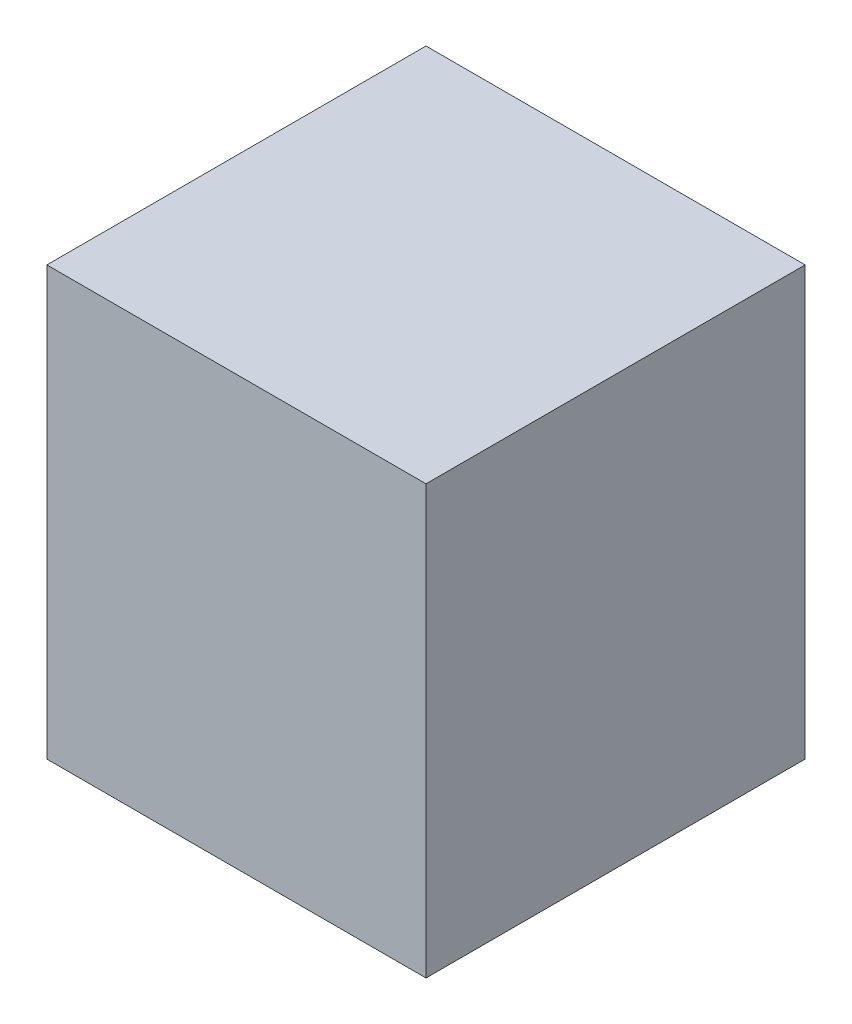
ISO-10303-21;
HEADER;
FILE_DESCRIPTION(('STEP AP214'),'2;1');
FILE_NAME('part.step','',(''),(''),'','','');
FILE_SCHEMA(('AUTOMOTIVE_DESIGN { 1 0 10303 214 1 1 1 1 }'));
ENDSEC;
DATA;
#1=APPLICATION_CONTEXT('core data for automotive mechanical design processes');
#2=APPLICATION_PROTOCOL_DEFINITION('international standard','automotive_design',2000,#1);
#3=PRODUCT_CONTEXT('',#1,'mechanical');
#4=PRODUCT('Part','Part','',(#3));
#5=PRODUCT_RELATED_PRODUCT_CATEGORY('part','',(#4));
#6=PRODUCT_DEFINITION_FORMATION('','',#4);
#7=PRODUCT_DEFINITION_CONTEXT('part definition',#1,'design');
#8=PRODUCT_DEFINITION('design','',#6,#7);
#9=PRODUCT_DEFINITION_SHAPE('','',#8);
#10=(LENGTH_UNIT() NAMED_UNIT(*) SI_UNIT(.MILLI.,.METRE.));
#11=(NAMED_UNIT(*) PLANE_ANGLE_UNIT() SI_UNIT($,.RADIAN.));
#12=(NAMED_UNIT(*) SI_UNIT($,.STERADIAN.) SOLID_ANGLE_UNIT());
#13=UNCERTAINTY_MEASURE_WITH_UNIT(LENGTH_MEASURE(1.E-05),#10,'distance_accuracy_value','');
#14=(GEOMETRIC_REPRESENTATION_CONTEXT(3) GLOBAL_UNCERTAINTY_ASSIGNED_CONTEXT((#13)) GLOBAL_UNIT_ASSIGNED_CONTEXT((#10,
#11,#12)) REPRESENTATION_CONTEXT('',''));
#15=CARTESIAN_POINT('',(0.,0.,0.));
#16=DIRECTION('',(0.,0.,1.));
#17=DIRECTION('',(1.,0.,0.));
#18=AXIS2_PLACEMENT_3D('',#15,#16,#17);
#19=CARTESIAN_POINT('',(0.,0.,1.79999894));
#20=DIRECTION('',(0.,0.,-1.));
#21=DIRECTION('',(0.,-1.,0.));
#22=AXIS2_PLACEMENT_3D('',#19,#20,#21);
#23=PLANE('',#22);
#24=DIRECTION('',(0.,-1.,0.));
#25=VECTOR('',#24,1.);
#26=CARTESIAN_POINT('',(0.90000074,1.016,1.79999894));
#27=LINE('',#26,#25);
#28=CARTESIAN_POINT('',(0.90000074,1.016,1.79999894));
#29=VERTEX_POINT('',#28);
#30=CARTESIAN_POINT('',(0.90000074,-1.016,1.79999894));
#31=VERTEX_POINT('',#30);
#32=EDGE_CURVE('E25',#29,#31,#27,.T.);
#33=ORIENTED_EDGE('',*,*,#32,.F.);
#34=DIRECTION('',(1.,0.,0.));
#35=VECTOR('',#34,1.);
#36=CARTESIAN_POINT('',(-0.90000074,1.016,1.79999894));
#37=LINE('',#36,#35);
#38=CARTESIAN_POINT('',(-0.90000074,1.016,1.79999894));
#39=VERTEX_POINT('',#38);
#40=EDGE_CURVE('E101',#39,#29,#37,.T.);
#41=ORIENTED_EDGE('',*,*,#40,.F.);
#42=DIRECTION('',(0.,1.,0.));
#43=VECTOR('',#42,1.);
#44=CARTESIAN_POINT('',(-0.90000074,-1.016,1.79999894));
#45=LINE('',#44,#43);
#46=CARTESIAN_POINT('',(-0.90000074,-1.016,1.79999894));
#47=VERTEX_POINT('',#46);
#48=EDGE_CURVE('E83',#47,#39,#45,.T.);
#49=ORIENTED_EDGE('',*,*,#48,.F.);
#50=DIRECTION('',(-1.,0.,0.));
#51=VECTOR('',#50,1.);
#52=CARTESIAN_POINT('',(0.90000074,-1.016,1.79999894));
#53=LINE('',#52,#51);
#54=EDGE_CURVE('E87',#31,#47,#53,.T.);
#55=ORIENTED_EDGE('',*,*,#54,.F.);
#56=EDGE_LOOP('',(#33,#41,#49,#55));
#57=FACE_BOUND('',#56,.T.);
#58=ADVANCED_FACE('F17',(#57),#23,.F.);
#59=CARTESIAN_POINT('',(0.,0.,0.));
#60=DIRECTION('',(0.,0.,-1.));
#61=DIRECTION('',(0.,-1.,0.));
#62=AXIS2_PLACEMENT_3D('',#59,#60,#61);
#63=PLANE('',#62);
#64=DIRECTION('',(-1.,0.,0.));
#65=VECTOR('',#64,1.);
#66=CARTESIAN_POINT('',(0.90000074,-1.016,0.));
#67=LINE('',#66,#65);
#68=CARTESIAN_POINT('',(0.90000074,-1.016,0.));
#69=VERTEX_POINT('',#68);
#70=CARTESIAN_POINT('',(-0.90000074,-1.016,0.));
#71=VERTEX_POINT('',#70);
#72=EDGE_CURVE('E71',#69,#71,#67,.T.);
#73=ORIENTED_EDGE('',*,*,#72,.T.);
#74=DIRECTION('',(0.,1.,0.));
#75=VECTOR('',#74,1.);
#76=CARTESIAN_POINT('',(-0.90000074,-1.016,0.));
#77=LINE('',#76,#75);
#78=CARTESIAN_POINT('',(-0.90000074,1.016,0.));
#79=VERTEX_POINT('',#78);
#80=EDGE_CURVE('E105',#71,#79,#77,.T.);
#81=ORIENTED_EDGE('',*,*,#80,.T.);
#82=DIRECTION('',(1.,0.,0.));
#83=VECTOR('',#82,1.);
#84=CARTESIAN_POINT('',(-0.90000074,1.016,0.));
#85=LINE('',#84,#83);
#86=CARTESIAN_POINT('',(0.90000074,1.016,0.));
#87=VERTEX_POINT('',#86);
#88=EDGE_CURVE('E73',#79,#87,#85,.T.);
#89=ORIENTED_EDGE('',*,*,#88,.T.);
#90=DIRECTION('',(0.,-1.,0.));
#91=VECTOR('',#90,1.);
#92=CARTESIAN_POINT('',(0.90000074,1.016,0.));
#93=LINE('',#92,#91);
#94=EDGE_CURVE('E11',#87,#69,#93,.T.);
#95=ORIENTED_EDGE('',*,*,#94,.T.);
#96=EDGE_LOOP('',(#73,#81,#89,#95));
#97=FACE_BOUND('',#96,.T.);
#98=ADVANCED_FACE('F69',(#97),#63,.T.);
#99=CARTESIAN_POINT('',(0.90000074,1.016,0.));
#100=DIRECTION('',(1.,0.,0.));
#101=DIRECTION('',(0.,1.,0.));
#102=AXIS2_PLACEMENT_3D('',#99,#100,#101);
#103=PLANE('',#102);
#104=DIRECTION('',(0.,0.,1.));
#105=VECTOR('',#104,1.);
#106=CARTESIAN_POINT('',(0.90000074,1.016,0.));
#107=LINE('',#106,#105);
#108=EDGE_CURVE('E97',#87,#29,#107,.T.);
#109=ORIENTED_EDGE('',*,*,#108,.T.);
#110=ORIENTED_EDGE('',*,*,#32,.T.);
#111=DIRECTION('',(0.,0.,1.));
#112=VECTOR('',#111,1.);
#113=CARTESIAN_POINT('',(0.90000074,-1.016,0.));
#114=LINE('',#113,#112);
#115=EDGE_CURVE('E79',#69,#31,#114,.T.);
#116=ORIENTED_EDGE('',*,*,#115,.F.);
#117=ORIENTED_EDGE('',*,*,#94,.F.);
#118=EDGE_LOOP('',(#109,#110,#116,#117));
#119=FACE_BOUND('',#118,.T.);
#120=ADVANCED_FACE('F85',(#119),#103,.T.);
#121=CARTESIAN_POINT('',(-0.90000074,1.016,0.));
#122=DIRECTION('',(0.,1.,0.));
#123=DIRECTION('',(1.,0.,0.));
#124=AXIS2_PLACEMENT_3D('',#121,#122,#123);
#125=PLANE('',#124);
#126=DIRECTION('',(0.,0.,1.));
#127=VECTOR('',#126,1.);
#128=CARTESIAN_POINT('',(-0.90000074,1.016,0.));
#129=LINE('',#128,#127);
#130=EDGE_CURVE('E108',#79,#39,#129,.T.);
#131=ORIENTED_EDGE('',*,*,#130,.T.);
#132=ORIENTED_EDGE('',*,*,#40,.T.);
#133=ORIENTED_EDGE('',*,*,#108,.F.);
#134=ORIENTED_EDGE('',*,*,#88,.F.);
#135=EDGE_LOOP('',(#131,#132,#133,#134));
#136=FACE_BOUND('',#135,.T.);
#137=ADVANCED_FACE('F157',(#136),#125,.T.);
#138=CARTESIAN_POINT('',(-0.90000074,-1.016,0.));
#139=DIRECTION('',(-1.,0.,0.));
#140=DIRECTION('',(0.,0.,1.));
#141=AXIS2_PLACEMENT_3D('',#138,#139,#140);
#142=PLANE('',#141);
#143=DIRECTION('',(0.,0.,1.));
#144=VECTOR('',#143,1.);
#145=CARTESIAN_POINT('',(-0.90000074,-1.016,0.));
#146=LINE('',#145,#144);
#147=EDGE_CURVE('E81',#71,#47,#146,.T.);
#148=ORIENTED_EDGE('',*,*,#147,.T.);
#149=ORIENTED_EDGE('',*,*,#48,.T.);
#150=ORIENTED_EDGE('',*,*,#130,.F.);
#151=ORIENTED_EDGE('',*,*,#80,.F.);
#152=EDGE_LOOP('',(#148,#149,#150,#151));
#153=FACE_BOUND('',#152,.T.);
#154=ADVANCED_FACE('F155',(#153),#142,.T.);
#155=CARTESIAN_POINT('',(0.90000074,-1.016,0.));
#156=DIRECTION('',(0.,-1.,0.));
#157=DIRECTION('',(0.,0.,-1.));
#158=AXIS2_PLACEMENT_3D('',#155,#156,#157);
#159=PLANE('',#158);
#160=ORIENTED_EDGE('',*,*,#115,.T.);
#161=ORIENTED_EDGE('',*,*,#54,.T.);
#162=ORIENTED_EDGE('',*,*,#147,.F.);
#163=ORIENTED_EDGE('',*,*,#72,.F.);
#164=EDGE_LOOP('',(#160,#161,#162,#163));
#165=FACE_BOUND('',#164,.T.);
#166=ADVANCED_FACE('F77',(#165),#159,.T.);
#167=CLOSED_SHELL('',(#58,#98,#120,#137,#154,#166));
#168=MANIFOLD_SOLID_BREP('B1',#167);
#169=ADVANCED_BREP_SHAPE_REPRESENTATION('',(#18,#168),#14);
#170=SHAPE_DEFINITION_REPRESENTATION(#9,#169);
ENDSEC;
END-ISO-10303-21;
